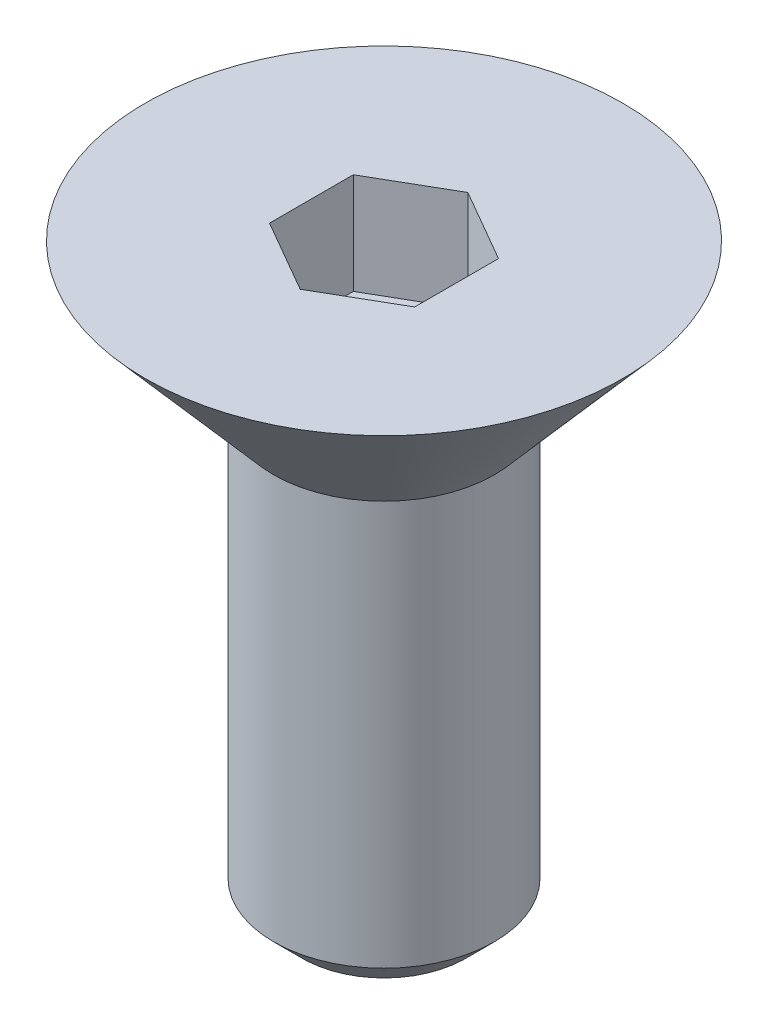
ISO-10303-21;
HEADER;
FILE_DESCRIPTION(('STEP AP214'),'2;1');
FILE_NAME('part.step','',(''),(''),'','','');
FILE_SCHEMA(('AUTOMOTIVE_DESIGN { 1 0 10303 214 1 1 1 1 }'));
ENDSEC;
DATA;
#1=APPLICATION_CONTEXT('core data for automotive mechanical design processes');
#2=APPLICATION_PROTOCOL_DEFINITION('international standard','automotive_design',2000,#1);
#3=PRODUCT_CONTEXT('',#1,'mechanical');
#4=PRODUCT('Part','Part','',(#3));
#5=PRODUCT_RELATED_PRODUCT_CATEGORY('part','',(#4));
#6=PRODUCT_DEFINITION_FORMATION('','',#4);
#7=PRODUCT_DEFINITION_CONTEXT('part definition',#1,'design');
#8=PRODUCT_DEFINITION('design','',#6,#7);
#9=PRODUCT_DEFINITION_SHAPE('','',#8);
#10=(LENGTH_UNIT() NAMED_UNIT(*) SI_UNIT(.MILLI.,.METRE.));
#11=(NAMED_UNIT(*) PLANE_ANGLE_UNIT() SI_UNIT($,.RADIAN.));
#12=(NAMED_UNIT(*) SI_UNIT($,.STERADIAN.) SOLID_ANGLE_UNIT());
#13=UNCERTAINTY_MEASURE_WITH_UNIT(LENGTH_MEASURE(1.E-05),#10,'distance_accuracy_value','');
#14=(GEOMETRIC_REPRESENTATION_CONTEXT(3) GLOBAL_UNCERTAINTY_ASSIGNED_CONTEXT((#13)) GLOBAL_UNIT_ASSIGNED_CONTEXT((#10,
#11,#12)) REPRESENTATION_CONTEXT('',''));
#15=CARTESIAN_POINT('',(0.,0.,0.));
#16=DIRECTION('',(0.,0.,1.));
#17=DIRECTION('',(1.,0.,0.));
#18=AXIS2_PLACEMENT_3D('',#15,#16,#17);
#19=CARTESIAN_POINT('',(0.,4.44089209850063E-13,1.33226762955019E-12));
#20=DIRECTION('',(0.,1.,0.));
#21=DIRECTION('',(0.,0.,1.00000000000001));
#22=AXIS2_PLACEMENT_3D('',#19,#20,#21);
#23=CONICAL_SURFACE('',#22,2.413,0.716035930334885);
#24=CARTESIAN_POINT('',(0.,3.22580000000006,8.88178419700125E-13));
#25=DIRECTION('',(0.,-1.,0.));
#26=DIRECTION('',(0.,0.,-1.00000000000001));
#27=AXIS2_PLACEMENT_3D('',#24,#25,#26);
#28=CIRCLE('',#27,5.2197);
#29=CARTESIAN_POINT('',(0.,3.22580000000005,-5.21969999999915));
#30=VERTEX_POINT('',#29);
#31=EDGE_CURVE('E39',#30,#30,#28,.T.);
#32=ORIENTED_EDGE('',*,*,#31,.T.);
#33=EDGE_LOOP('',(#32));
#34=FACE_BOUND('',#33,.T.);
#35=CARTESIAN_POINT('',(0.,4.44089209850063E-13,1.33226762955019E-12));
#36=DIRECTION('',(0.,-1.,0.));
#37=DIRECTION('',(0.,0.,-1.00000000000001));
#38=AXIS2_PLACEMENT_3D('',#35,#36,#37);
#39=CIRCLE('',#38,2.413);
#40=CARTESIAN_POINT('',(0.,4.43151570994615E-13,-2.41299999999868));
#41=VERTEX_POINT('',#40);
#42=EDGE_CURVE('E11',#41,#41,#39,.T.);
#43=ORIENTED_EDGE('',*,*,#42,.F.);
#44=EDGE_LOOP('',(#43));
#45=FACE_BOUND('',#44,.T.);
#46=ADVANCED_FACE('F32',(#34,#45),#23,.T.);
#47=CARTESIAN_POINT('',(5.21969999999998,3.22579999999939,1.11022302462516E-12));
#48=DIRECTION('',(0.,1.,0.));
#49=DIRECTION('',(0.,0.,1.00000000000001));
#50=AXIS2_PLACEMENT_3D('',#47,#48,#49);
#51=PLANE('',#50);
#52=DIRECTION('',(1.02022557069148E-11,0.,1.00000000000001));
#53=VECTOR('',#52,1.);
#54=CARTESIAN_POINT('',(-1.58750000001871,3.22579999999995,-0.916543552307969));
#55=LINE('',#54,#53);
#56=CARTESIAN_POINT('',(-1.58750000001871,3.22579999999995,-0.916543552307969));
#57=VERTEX_POINT('',#56);
#58=CARTESIAN_POINT('',(-1.58750000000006,3.22579999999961,0.916543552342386));
#59=VERTEX_POINT('',#58);
#60=EDGE_CURVE('E46',#57,#59,#55,.T.);
#61=ORIENTED_EDGE('',*,*,#60,.F.);
#62=DIRECTION('',(-0.866025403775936,0.,0.50000000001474));
#63=VECTOR('',#62,1.);
#64=CARTESIAN_POINT('',(-2.80053757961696E-11,3.22580000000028,-1.833087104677));
#65=LINE('',#64,#63);
#66=CARTESIAN_POINT('',(-2.80053757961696E-11,3.22580000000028,-1.833087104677));
#67=VERTEX_POINT('',#66);
#68=EDGE_CURVE('E116',#67,#57,#65,.T.);
#69=ORIENTED_EDGE('',*,*,#68,.F.);
#70=DIRECTION('',(-0.866025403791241,0.,-0.499999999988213));
#71=VECTOR('',#70,1.);
#72=CARTESIAN_POINT('',(1.58749999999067,3.22579999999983,-0.916543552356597));
#73=LINE('',#72,#71);
#74=CARTESIAN_POINT('',(1.58749999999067,3.22579999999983,-0.916543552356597));
#75=VERTEX_POINT('',#74);
#76=EDGE_CURVE('E110',#75,#67,#73,.T.);
#77=ORIENTED_EDGE('',*,*,#76,.F.);
#78=DIRECTION('',(-1.02016173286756E-11,0.,-1.00000000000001));
#79=VECTOR('',#78,1.);
#80=CARTESIAN_POINT('',(1.58750000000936,3.22580000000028,0.916543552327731));
#81=LINE('',#80,#79);
#82=CARTESIAN_POINT('',(1.58750000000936,3.22580000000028,0.916543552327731));
#83=VERTEX_POINT('',#82);
#84=EDGE_CURVE('E108',#83,#75,#81,.T.);
#85=ORIENTED_EDGE('',*,*,#84,.F.);
#86=DIRECTION('',(0.86602540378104,0.,-0.500000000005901));
#87=VECTOR('',#86,1.);
#88=CARTESIAN_POINT('',(9.33975119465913E-12,3.22579999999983,1.83308710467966));
#89=LINE('',#88,#87);
#90=CARTESIAN_POINT('',(9.33975119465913E-12,3.22579999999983,1.83308710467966));
#91=VERTEX_POINT('',#90);
#92=EDGE_CURVE('E89',#91,#83,#89,.T.);
#93=ORIENTED_EDGE('',*,*,#92,.F.);
#94=DIRECTION('',(0.866025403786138,0.,0.499999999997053));
#95=VECTOR('',#94,1.);
#96=CARTESIAN_POINT('',(-1.58750000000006,3.22579999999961,0.916543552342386));
#97=LINE('',#96,#95);
#98=EDGE_CURVE('E100',#59,#91,#97,.T.);
#99=ORIENTED_EDGE('',*,*,#98,.F.);
#100=EDGE_LOOP('',(#61,#69,#77,#85,#93,#99));
#101=FACE_BOUND('',#100,.T.);
#102=ORIENTED_EDGE('',*,*,#31,.F.);
#103=EDGE_LOOP('',(#102));
#104=FACE_BOUND('',#103,.T.);
#105=ADVANCED_FACE('F104',(#101,#104),#51,.T.);
#106=CARTESIAN_POINT('',(-1.2490009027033E-13,-9.47420000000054,2.22044604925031E-12));
#107=DIRECTION('',(0.,-1.,0.));
#108=DIRECTION('',(0.,0.,-1.00000000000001));
#109=AXIS2_PLACEMENT_3D('',#106,#107,#108);
#110=PLANE('',#109);
#111=CARTESIAN_POINT('',(-1.2490009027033E-13,-9.47420000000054,2.22044604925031E-12));
#112=DIRECTION('',(0.,-1.,0.));
#113=DIRECTION('',(0.,0.,-1.00000000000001));
#114=AXIS2_PLACEMENT_3D('',#111,#112,#113);
#115=CIRCLE('',#114,1.78308);
#116=CARTESIAN_POINT('',(-1.16486720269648E-13,-9.47420000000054,-1.78307999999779));
#117=VERTEX_POINT('',#116);
#118=EDGE_CURVE('E143',#117,#117,#115,.T.);
#119=ORIENTED_EDGE('',*,*,#118,.T.);
#120=EDGE_LOOP('',(#119));
#121=FACE_BOUND('',#120,.T.);
#122=ADVANCED_FACE('F150',(#121),#110,.T.);
#123=CARTESIAN_POINT('',(-1.2490009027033E-13,-9.47420000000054,2.22044604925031E-12));
#124=DIRECTION('',(0.,1.,0.));
#125=DIRECTION('',(0.,0.,1.00000000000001));
#126=AXIS2_PLACEMENT_3D('',#123,#124,#125);
#127=CONICAL_SURFACE('',#126,1.78308,0.785398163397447);
#128=CARTESIAN_POINT('',(0.,-8.8442799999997,8.88178419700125E-13));
#129=DIRECTION('',(0.,-1.,0.));
#130=DIRECTION('',(0.,0.,-1.00000000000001));
#131=AXIS2_PLACEMENT_3D('',#128,#129,#130);
#132=CIRCLE('',#131,2.413);
#133=CARTESIAN_POINT('',(0.,-8.84427999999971,-2.41299999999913));
#134=VERTEX_POINT('',#133);
#135=EDGE_CURVE('E134',#134,#134,#132,.T.);
#136=ORIENTED_EDGE('',*,*,#135,.T.);
#137=EDGE_LOOP('',(#136));
#138=FACE_BOUND('',#137,.T.);
#139=ORIENTED_EDGE('',*,*,#118,.F.);
#140=EDGE_LOOP('',(#139));
#141=FACE_BOUND('',#140,.T.);
#142=ADVANCED_FACE('F155',(#138,#141),#127,.T.);
#143=CARTESIAN_POINT('',(0.,4.44089209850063E-13,1.33226762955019E-12));
#144=DIRECTION('',(0.,-1.,0.));
#145=DIRECTION('',(0.,0.,-1.00000000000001));
#146=AXIS2_PLACEMENT_3D('',#143,#144,#145);
#147=CYLINDRICAL_SURFACE('',#146,2.413);
#148=ORIENTED_EDGE('',*,*,#42,.T.);
#149=EDGE_LOOP('',(#148));
#150=FACE_BOUND('',#149,.T.);
#151=ORIENTED_EDGE('',*,*,#135,.F.);
#152=EDGE_LOOP('',(#151));
#153=FACE_BOUND('',#152,.T.);
#154=ADVANCED_FACE('F161',(#150,#153),#147,.T.);
#155=CARTESIAN_POINT('',(-1.58750000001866,1.01599999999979,-0.916543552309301));
#156=DIRECTION('',(-1.,0.,1.02119424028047E-11));
#157=DIRECTION('',(1.02022834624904E-11,0.,1.00000000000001));
#158=AXIS2_PLACEMENT_3D('',#155,#156,#157);
#159=PLANE('',#158);
#160=ORIENTED_EDGE('',*,*,#60,.T.);
#161=DIRECTION('',(0.,1.,0.));
#162=VECTOR('',#161,1.);
#163=CARTESIAN_POINT('',(-1.5875000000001,1.01599999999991,0.916543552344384));
#164=LINE('',#163,#162);
#165=CARTESIAN_POINT('',(-1.5875000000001,1.01599999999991,0.916543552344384));
#166=VERTEX_POINT('',#165);
#167=EDGE_CURVE('E97',#166,#59,#164,.T.);
#168=ORIENTED_EDGE('',*,*,#167,.F.);
#169=DIRECTION('',(1.02022557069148E-11,0.,1.00000000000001));
#170=VECTOR('',#169,1.);
#171=CARTESIAN_POINT('',(-1.58750000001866,1.01599999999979,-0.916543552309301));
#172=LINE('',#171,#170);
#173=CARTESIAN_POINT('',(-1.58750000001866,1.01599999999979,-0.916543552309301));
#174=VERTEX_POINT('',#173);
#175=EDGE_CURVE('E118',#174,#166,#172,.T.);
#176=ORIENTED_EDGE('',*,*,#175,.F.);
#177=DIRECTION('',(0.,1.,0.));
#178=VECTOR('',#177,1.);
#179=CARTESIAN_POINT('',(-1.58750000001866,1.01599999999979,-0.916543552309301));
#180=LINE('',#179,#178);
#181=EDGE_CURVE('E53',#174,#57,#180,.T.);
#182=ORIENTED_EDGE('',*,*,#181,.T.);
#183=EDGE_LOOP('',(#160,#168,#176,#182));
#184=FACE_BOUND('',#183,.T.);
#185=ADVANCED_FACE('F165',(#184),#159,.F.);
#186=CARTESIAN_POINT('',(-2.79776202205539E-11,1.01600000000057,-1.83308710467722));
#187=DIRECTION('',(-0.500000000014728,0.,-0.866025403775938));
#188=DIRECTION('',(-0.866025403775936,0.,0.50000000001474));
#189=AXIS2_PLACEMENT_3D('',#186,#187,#188);
#190=PLANE('',#189);
#191=ORIENTED_EDGE('',*,*,#68,.T.);
#192=ORIENTED_EDGE('',*,*,#181,.F.);
#193=DIRECTION('',(-0.866025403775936,0.,0.50000000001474));
#194=VECTOR('',#193,1.);
#195=CARTESIAN_POINT('',(-2.79776202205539E-11,1.01600000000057,-1.83308710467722));
#196=LINE('',#195,#194);
#197=CARTESIAN_POINT('',(-2.79776202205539E-11,1.01600000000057,-1.83308710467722));
#198=VERTEX_POINT('',#197);
#199=EDGE_CURVE('E130',#198,#174,#196,.T.);
#200=ORIENTED_EDGE('',*,*,#199,.F.);
#201=DIRECTION('',(0.,1.,0.));
#202=VECTOR('',#201,1.);
#203=CARTESIAN_POINT('',(-2.79776202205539E-11,1.01600000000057,-1.83308710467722));
#204=LINE('',#203,#202);
#205=EDGE_CURVE('E135',#198,#67,#204,.T.);
#206=ORIENTED_EDGE('',*,*,#205,.T.);
#207=EDGE_LOOP('',(#191,#192,#200,#206));
#208=FACE_BOUND('',#207,.T.);
#209=ADVANCED_FACE('F169',(#208),#190,.F.);
#210=CARTESIAN_POINT('',(1.58749999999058,1.01600000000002,-0.916543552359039));
#211=DIRECTION('',(0.499999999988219,0.,-0.866025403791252));
#212=DIRECTION('',(-0.866025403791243,0.,-0.499999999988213));
#213=AXIS2_PLACEMENT_3D('',#210,#211,#212);
#214=PLANE('',#213);
#215=ORIENTED_EDGE('',*,*,#76,.T.);
#216=ORIENTED_EDGE('',*,*,#205,.F.);
#217=DIRECTION('',(-0.866025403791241,0.,-0.499999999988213));
#218=VECTOR('',#217,1.);
#219=CARTESIAN_POINT('',(1.58749999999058,1.01600000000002,-0.916543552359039));
#220=LINE('',#219,#218);
#221=CARTESIAN_POINT('',(1.58749999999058,1.01600000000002,-0.916543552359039));
#222=VERTEX_POINT('',#221);
#223=EDGE_CURVE('E127',#222,#198,#220,.T.);
#224=ORIENTED_EDGE('',*,*,#223,.F.);
#225=DIRECTION('',(0.,1.,0.));
#226=VECTOR('',#225,1.);
#227=CARTESIAN_POINT('',(1.58749999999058,1.01600000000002,-0.916543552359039));
#228=LINE('',#227,#226);
#229=EDGE_CURVE('E137',#222,#75,#228,.T.);
#230=ORIENTED_EDGE('',*,*,#229,.T.);
#231=EDGE_LOOP('',(#215,#216,#224,#230));
#232=FACE_BOUND('',#231,.T.);
#233=ADVANCED_FACE('F178',(#232),#214,.F.);
#234=CARTESIAN_POINT('',(1.58750000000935,1.01599999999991,0.916543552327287));
#235=DIRECTION('',(1.,0.,-1.02118868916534E-11));
#236=DIRECTION('',(-1.02016173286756E-11,0.,-1.00000000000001));
#237=AXIS2_PLACEMENT_3D('',#234,#235,#236);
#238=PLANE('',#237);
#239=ORIENTED_EDGE('',*,*,#84,.T.);
#240=ORIENTED_EDGE('',*,*,#229,.F.);
#241=DIRECTION('',(-1.02016173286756E-11,0.,-1.00000000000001));
#242=VECTOR('',#241,1.);
#243=CARTESIAN_POINT('',(1.58750000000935,1.01599999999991,0.916543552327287));
#244=LINE('',#243,#242);
#245=CARTESIAN_POINT('',(1.58750000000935,1.01599999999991,0.916543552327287));
#246=VERTEX_POINT('',#245);
#247=EDGE_CURVE('E124',#246,#222,#244,.T.);
#248=ORIENTED_EDGE('',*,*,#247,.F.);
#249=DIRECTION('',(0.,1.,0.));
#250=VECTOR('',#249,1.);
#251=CARTESIAN_POINT('',(1.58750000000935,1.01599999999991,0.916543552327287));
#252=LINE('',#251,#250);
#253=EDGE_CURVE('E96',#246,#83,#252,.T.);
#254=ORIENTED_EDGE('',*,*,#253,.T.);
#255=EDGE_LOOP('',(#239,#240,#248,#254));
#256=FACE_BOUND('',#255,.T.);
#257=ADVANCED_FACE('F175',(#256),#238,.F.);
#258=CARTESIAN_POINT('',(9.35362898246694E-12,1.01600000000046,1.83308710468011));
#259=DIRECTION('',(0.500000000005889,0.,0.86602540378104));
#260=DIRECTION('',(0.86602540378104,0.,-0.500000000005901));
#261=AXIS2_PLACEMENT_3D('',#258,#259,#260);
#262=PLANE('',#261);
#263=ORIENTED_EDGE('',*,*,#92,.T.);
#264=ORIENTED_EDGE('',*,*,#253,.F.);
#265=DIRECTION('',(0.86602540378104,0.,-0.500000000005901));
#266=VECTOR('',#265,1.);
#267=CARTESIAN_POINT('',(9.35362898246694E-12,1.01600000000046,1.83308710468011));
#268=LINE('',#267,#266);
#269=CARTESIAN_POINT('',(9.35362898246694E-12,1.01600000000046,1.83308710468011));
#270=VERTEX_POINT('',#269);
#271=EDGE_CURVE('E92',#270,#246,#268,.T.);
#272=ORIENTED_EDGE('',*,*,#271,.F.);
#273=DIRECTION('',(0.,1.,0.));
#274=VECTOR('',#273,1.);
#275=CARTESIAN_POINT('',(9.35362898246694E-12,1.01600000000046,1.83308710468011));
#276=LINE('',#275,#274);
#277=EDGE_CURVE('E85',#270,#91,#276,.T.);
#278=ORIENTED_EDGE('',*,*,#277,.T.);
#279=EDGE_LOOP('',(#263,#264,#272,#278));
#280=FACE_BOUND('',#279,.T.);
#281=ADVANCED_FACE('F87',(#280),#262,.F.);
#282=CARTESIAN_POINT('',(-1.5875000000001,1.01599999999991,0.916543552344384));
#283=DIRECTION('',(-0.499999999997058,0.,0.866025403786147));
#284=DIRECTION('',(0.866025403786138,0.,0.499999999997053));
#285=AXIS2_PLACEMENT_3D('',#282,#283,#284);
#286=PLANE('',#285);
#287=ORIENTED_EDGE('',*,*,#98,.T.);
#288=ORIENTED_EDGE('',*,*,#277,.F.);
#289=DIRECTION('',(0.866025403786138,0.,0.499999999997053));
#290=VECTOR('',#289,1.);
#291=CARTESIAN_POINT('',(-1.5875000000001,1.01599999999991,0.916543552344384));
#292=LINE('',#291,#290);
#293=EDGE_CURVE('E121',#166,#270,#292,.T.);
#294=ORIENTED_EDGE('',*,*,#293,.F.);
#295=ORIENTED_EDGE('',*,*,#167,.T.);
#296=EDGE_LOOP('',(#287,#288,#294,#295));
#297=FACE_BOUND('',#296,.T.);
#298=ADVANCED_FACE('F101',(#297),#286,.F.);
#299=CARTESIAN_POINT('',(-1.58749999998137,1.01599999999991,2.74963065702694));
#300=DIRECTION('',(0.,1.,0.));
#301=DIRECTION('',(0.,0.,1.00000000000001));
#302=AXIS2_PLACEMENT_3D('',#299,#300,#301);
#303=PLANE('',#302);
#304=ORIENTED_EDGE('',*,*,#175,.T.);
#305=ORIENTED_EDGE('',*,*,#293,.T.);
#306=ORIENTED_EDGE('',*,*,#271,.T.);
#307=ORIENTED_EDGE('',*,*,#247,.T.);
#308=ORIENTED_EDGE('',*,*,#223,.T.);
#309=ORIENTED_EDGE('',*,*,#199,.T.);
#310=EDGE_LOOP('',(#304,#305,#306,#307,#308,#309));
#311=FACE_BOUND('',#310,.T.);
#312=ADVANCED_FACE('F172',(#311),#303,.T.);
#313=CLOSED_SHELL('',(#46,#105,#122,#142,#154,#185,#209,#233,#257,#281,#298,#312));
#314=MANIFOLD_SOLID_BREP('B2',#313);
#315=ADVANCED_BREP_SHAPE_REPRESENTATION('',(#18,#314),#14);
#316=SHAPE_DEFINITION_REPRESENTATION(#9,#315);
ENDSEC;
END-ISO-10303-21;
